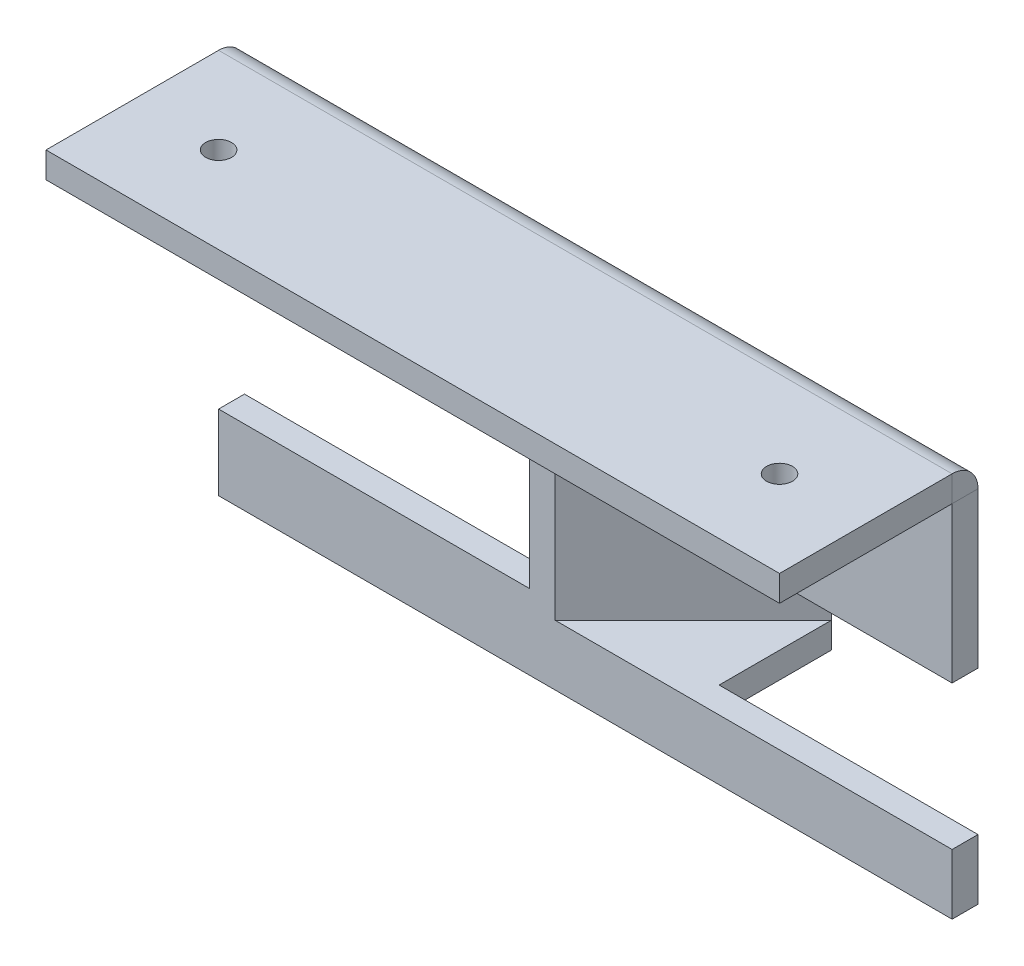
ISO-10303-21;
HEADER;
FILE_DESCRIPTION(('STEP AP214'),'2;1');
FILE_NAME('part.step','',(''),(''),'','','');
FILE_SCHEMA(('AUTOMOTIVE_DESIGN { 1 0 10303 214 1 1 1 1 }'));
ENDSEC;
DATA;
#1=APPLICATION_CONTEXT('core data for automotive mechanical design processes');
#2=APPLICATION_PROTOCOL_DEFINITION('international standard','automotive_design',2000,#1);
#3=PRODUCT_CONTEXT('',#1,'mechanical');
#4=PRODUCT('Part','Part','',(#3));
#5=PRODUCT_RELATED_PRODUCT_CATEGORY('part','',(#4));
#6=PRODUCT_DEFINITION_FORMATION('','',#4);
#7=PRODUCT_DEFINITION_CONTEXT('part definition',#1,'design');
#8=PRODUCT_DEFINITION('design','',#6,#7);
#9=PRODUCT_DEFINITION_SHAPE('','',#8);
#10=(LENGTH_UNIT() NAMED_UNIT(*) SI_UNIT(.MILLI.,.METRE.));
#11=(NAMED_UNIT(*) PLANE_ANGLE_UNIT() SI_UNIT($,.RADIAN.));
#12=(NAMED_UNIT(*) SI_UNIT($,.STERADIAN.) SOLID_ANGLE_UNIT());
#13=UNCERTAINTY_MEASURE_WITH_UNIT(LENGTH_MEASURE(1.E-05),#10,'distance_accuracy_value','');
#14=(GEOMETRIC_REPRESENTATION_CONTEXT(3) GLOBAL_UNCERTAINTY_ASSIGNED_CONTEXT((#13)) GLOBAL_UNIT_ASSIGNED_CONTEXT((#10,
#11,#12)) REPRESENTATION_CONTEXT('',''));
#15=CARTESIAN_POINT('',(0.,0.,0.));
#16=DIRECTION('',(0.,0.,1.));
#17=DIRECTION('',(1.,0.,0.));
#18=AXIS2_PLACEMENT_3D('',#15,#16,#17);
#19=CARTESIAN_POINT('',(42.5,1.5,20.));
#20=DIRECTION('',(-1.,0.,0.));
#21=DIRECTION('',(0.,0.,-1.));
#22=AXIS2_PLACEMENT_3D('',#19,#20,#21);
#23=PLANE('',#22);
#24=DIRECTION('',(0.,0.,-1.));
#25=VECTOR('',#24,1.);
#26=CARTESIAN_POINT('',(42.5,1.5,20.));
#27=LINE('',#26,#25);
#28=CARTESIAN_POINT('',(42.5,1.5,0.));
#29=VERTEX_POINT('',#28);
#30=CARTESIAN_POINT('',(42.5,1.5,-20.));
#31=VERTEX_POINT('',#30);
#32=EDGE_CURVE('E50',#29,#31,#27,.T.);
#33=ORIENTED_EDGE('',*,*,#32,.F.);
#34=DIRECTION('',(0.,1.,0.));
#35=VECTOR('',#34,1.);
#36=CARTESIAN_POINT('',(42.5,-75.5,0.));
#37=LINE('',#36,#35);
#38=CARTESIAN_POINT('',(42.5,-1.5,0.));
#39=VERTEX_POINT('',#38);
#40=EDGE_CURVE('E181',#39,#29,#37,.T.);
#41=ORIENTED_EDGE('',*,*,#40,.F.);
#42=DIRECTION('',(0.,0.,-1.));
#43=VECTOR('',#42,1.);
#44=CARTESIAN_POINT('',(42.5,-1.5,20.));
#45=LINE('',#44,#43);
#46=CARTESIAN_POINT('',(42.5,-1.5,-20.));
#47=VERTEX_POINT('',#46);
#48=EDGE_CURVE('E199',#39,#47,#45,.T.);
#49=ORIENTED_EDGE('',*,*,#48,.T.);
#50=DIRECTION('',(0.,1.,0.));
#51=VECTOR('',#50,1.);
#52=CARTESIAN_POINT('',(42.5,1.5,-20.));
#53=LINE('',#52,#51);
#54=EDGE_CURVE('E338',#47,#31,#53,.T.);
#55=ORIENTED_EDGE('',*,*,#54,.T.);
#56=EDGE_LOOP('',(#33,#41,#49,#55));
#57=FACE_BOUND('',#56,.T.);
#58=ADVANCED_FACE('F41',(#57),#23,.F.);
#59=CARTESIAN_POINT('',(-42.5,1.5,20.));
#60=DIRECTION('',(-1.,0.,0.));
#61=DIRECTION('',(0.,0.,-1.));
#62=AXIS2_PLACEMENT_3D('',#59,#60,#61);
#63=PLANE('',#62);
#64=DIRECTION('',(0.,0.,-1.));
#65=VECTOR('',#64,1.);
#66=CARTESIAN_POINT('',(-42.5,-1.5,20.));
#67=LINE('',#66,#65);
#68=CARTESIAN_POINT('',(-42.5,-1.5,0.));
#69=VERTEX_POINT('',#68);
#70=CARTESIAN_POINT('',(-42.5,-1.5,-20.));
#71=VERTEX_POINT('',#70);
#72=EDGE_CURVE('E192',#69,#71,#67,.T.);
#73=ORIENTED_EDGE('',*,*,#72,.F.);
#74=DIRECTION('',(0.,1.,0.));
#75=VECTOR('',#74,1.);
#76=CARTESIAN_POINT('',(-42.5,-75.5,0.));
#77=LINE('',#76,#75);
#78=CARTESIAN_POINT('',(-42.5,1.5,0.));
#79=VERTEX_POINT('',#78);
#80=EDGE_CURVE('E58',#69,#79,#77,.T.);
#81=ORIENTED_EDGE('',*,*,#80,.T.);
#82=DIRECTION('',(0.,0.,-1.));
#83=VECTOR('',#82,1.);
#84=CARTESIAN_POINT('',(-42.5,1.5,20.));
#85=LINE('',#84,#83);
#86=CARTESIAN_POINT('',(-42.5,1.5,-20.));
#87=VERTEX_POINT('',#86);
#88=EDGE_CURVE('E190',#79,#87,#85,.T.);
#89=ORIENTED_EDGE('',*,*,#88,.T.);
#90=DIRECTION('',(0.,1.,0.));
#91=VECTOR('',#90,1.);
#92=CARTESIAN_POINT('',(-42.5,1.5,-20.));
#93=LINE('',#92,#91);
#94=EDGE_CURVE('E343',#71,#87,#93,.T.);
#95=ORIENTED_EDGE('',*,*,#94,.F.);
#96=EDGE_LOOP('',(#73,#81,#89,#95));
#97=FACE_BOUND('',#96,.T.);
#98=ADVANCED_FACE('F43',(#97),#63,.T.);
#99=CARTESIAN_POINT('',(-42.5,1.5,20.));
#100=DIRECTION('',(0.,-1.,0.));
#101=DIRECTION('',(0.,0.,-1.));
#102=AXIS2_PLACEMENT_3D('',#99,#100,#101);
#103=PLANE('',#102);
#104=CARTESIAN_POINT('',(32.5,1.5,-9.99999999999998));
#105=DIRECTION('',(0.,1.,0.));
#106=DIRECTION('',(0.,0.,-1.));
#107=AXIS2_PLACEMENT_3D('',#104,#105,#106);
#108=CIRCLE('',#107,1.5);
#109=CARTESIAN_POINT('',(32.5,1.5,-11.5));
#110=VERTEX_POINT('',#109);
#111=EDGE_CURVE('E216',#110,#110,#108,.T.);
#112=ORIENTED_EDGE('',*,*,#111,.F.);
#113=EDGE_LOOP('',(#112));
#114=FACE_BOUND('',#113,.T.);
#115=CARTESIAN_POINT('',(-32.5,1.5,-9.99999999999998));
#116=DIRECTION('',(0.,1.,0.));
#117=DIRECTION('',(0.,0.,1.));
#118=AXIS2_PLACEMENT_3D('',#115,#116,#117);
#119=CIRCLE('',#118,1.5);
#120=CARTESIAN_POINT('',(-32.5,1.5,-8.49999999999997));
#121=VERTEX_POINT('',#120);
#122=EDGE_CURVE('E208',#121,#121,#119,.T.);
#123=ORIENTED_EDGE('',*,*,#122,.F.);
#124=EDGE_LOOP('',(#123));
#125=FACE_BOUND('',#124,.T.);
#126=DIRECTION('',(1.,0.,0.));
#127=VECTOR('',#126,1.);
#128=CARTESIAN_POINT('',(0.,1.5,0.));
#129=LINE('',#128,#127);
#130=EDGE_CURVE('E178',#79,#29,#129,.T.);
#131=ORIENTED_EDGE('',*,*,#130,.T.);
#132=ORIENTED_EDGE('',*,*,#32,.T.);
#133=DIRECTION('',(-1.,0.,0.));
#134=VECTOR('',#133,1.);
#135=CARTESIAN_POINT('',(-42.5,1.5,-20.));
#136=LINE('',#135,#134);
#137=EDGE_CURVE('E197',#31,#87,#136,.T.);
#138=ORIENTED_EDGE('',*,*,#137,.T.);
#139=ORIENTED_EDGE('',*,*,#88,.F.);
#140=EDGE_LOOP('',(#131,#132,#138,#139));
#141=FACE_BOUND('',#140,.T.);
#142=ADVANCED_FACE('F195',(#114,#125,#141),#103,.F.);
#143=CARTESIAN_POINT('',(-42.5,-1.5,20.));
#144=DIRECTION('',(0.,-1.,0.));
#145=DIRECTION('',(0.,0.,-1.));
#146=AXIS2_PLACEMENT_3D('',#143,#144,#145);
#147=PLANE('',#146);
#148=CARTESIAN_POINT('',(32.5,-1.5,-9.99999999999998));
#149=DIRECTION('',(0.,-1.,0.));
#150=DIRECTION('',(0.,0.,-1.));
#151=AXIS2_PLACEMENT_3D('',#148,#149,#150);
#152=CIRCLE('',#151,1.5);
#153=CARTESIAN_POINT('',(32.5,-1.5,-11.5));
#154=VERTEX_POINT('',#153);
#155=EDGE_CURVE('E45',#154,#154,#152,.T.);
#156=ORIENTED_EDGE('',*,*,#155,.F.);
#157=EDGE_LOOP('',(#156));
#158=FACE_BOUND('',#157,.T.);
#159=CARTESIAN_POINT('',(-32.5,-1.5,-9.99999999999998));
#160=DIRECTION('',(0.,-1.,0.));
#161=DIRECTION('',(0.,0.,-1.));
#162=AXIS2_PLACEMENT_3D('',#159,#160,#161);
#163=CIRCLE('',#162,1.5);
#164=CARTESIAN_POINT('',(-32.5,-1.5,-11.5));
#165=VERTEX_POINT('',#164);
#166=EDGE_CURVE('E185',#165,#165,#163,.T.);
#167=ORIENTED_EDGE('',*,*,#166,.F.);
#168=EDGE_LOOP('',(#167));
#169=FACE_BOUND('',#168,.T.);
#170=ORIENTED_EDGE('',*,*,#48,.F.);
#171=DIRECTION('',(-1.,0.,0.));
#172=VECTOR('',#171,1.);
#173=CARTESIAN_POINT('',(-42.5,-1.5,0.));
#174=LINE('',#173,#172);
#175=EDGE_CURVE('E12',#39,#69,#174,.T.);
#176=ORIENTED_EDGE('',*,*,#175,.T.);
#177=ORIENTED_EDGE('',*,*,#72,.T.);
#178=DIRECTION('',(1.,0.,0.));
#179=VECTOR('',#178,1.);
#180=CARTESIAN_POINT('',(-42.5,-1.5,-20.));
#181=LINE('',#180,#179);
#182=EDGE_CURVE('E336',#47,#71,#181,.F.);
#183=ORIENTED_EDGE('',*,*,#182,.F.);
#184=EDGE_LOOP('',(#170,#176,#177,#183));
#185=FACE_BOUND('',#184,.T.);
#186=ADVANCED_FACE('F440',(#158,#169,#185),#147,.T.);
#187=CARTESIAN_POINT('',(0.,0.,-20.));
#188=DIRECTION('',(0.,0.,-1.));
#189=DIRECTION('',(0.,-1.,0.));
#190=AXIS2_PLACEMENT_3D('',#187,#188,#189);
#191=PLANE('',#190);
#192=DIRECTION('',(0.,1.,0.));
#193=VECTOR('',#192,1.);
#194=CARTESIAN_POINT('',(-3.50000000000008,0.,-20.));
#195=LINE('',#194,#193);
#196=CARTESIAN_POINT('',(-3.50000000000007,-36.2,-20.0000000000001));
#197=VERTEX_POINT('',#196);
#198=CARTESIAN_POINT('',(-3.50000000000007,-19.5,-20.0000000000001));
#199=VERTEX_POINT('',#198);
#200=EDGE_CURVE('E219',#197,#199,#195,.T.);
#201=ORIENTED_EDGE('',*,*,#200,.T.);
#202=DIRECTION('',(1.,0.,0.));
#203=VECTOR('',#202,1.);
#204=CARTESIAN_POINT('',(0.,-19.5,-20.0000000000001));
#205=LINE('',#204,#203);
#206=CARTESIAN_POINT('',(42.5,-19.5,-20.));
#207=VERTEX_POINT('',#206);
#208=EDGE_CURVE('E227',#199,#207,#205,.T.);
#209=ORIENTED_EDGE('',*,*,#208,.T.);
#210=DIRECTION('',(0.,-1.,0.));
#211=VECTOR('',#210,1.);
#212=CARTESIAN_POINT('',(42.5,-43.2,-20.0000000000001));
#213=LINE('',#212,#211);
#214=EDGE_CURVE('E314',#47,#207,#213,.T.);
#215=ORIENTED_EDGE('',*,*,#214,.F.);
#216=ORIENTED_EDGE('',*,*,#182,.T.);
#217=DIRECTION('',(0.,1.,0.));
#218=VECTOR('',#217,1.);
#219=CARTESIAN_POINT('',(-42.5,-1.5,-20.));
#220=LINE('',#219,#218);
#221=CARTESIAN_POINT('',(-42.5,-21.5,-20.0000000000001));
#222=VERTEX_POINT('',#221);
#223=EDGE_CURVE('E320',#222,#71,#220,.T.);
#224=ORIENTED_EDGE('',*,*,#223,.F.);
#225=DIRECTION('',(-1.,0.,0.));
#226=VECTOR('',#225,1.);
#227=CARTESIAN_POINT('',(0.,-21.5,-20.0000000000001));
#228=LINE('',#227,#226);
#229=CARTESIAN_POINT('',(-6.50000000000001,-21.5,-20.0000000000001));
#230=VERTEX_POINT('',#229);
#231=EDGE_CURVE('E349',#230,#222,#228,.T.);
#232=ORIENTED_EDGE('',*,*,#231,.F.);
#233=DIRECTION('',(0.,1.,0.));
#234=VECTOR('',#233,1.);
#235=CARTESIAN_POINT('',(-6.50000000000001,0.,-20.));
#236=LINE('',#235,#234);
#237=CARTESIAN_POINT('',(-6.50000000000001,-34.5,-20.0000000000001));
#238=VERTEX_POINT('',#237);
#239=EDGE_CURVE('E347',#238,#230,#236,.T.);
#240=ORIENTED_EDGE('',*,*,#239,.F.);
#241=DIRECTION('',(1.,0.,0.));
#242=VECTOR('',#241,1.);
#243=CARTESIAN_POINT('',(0.,-34.5,-20.0000000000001));
#244=LINE('',#243,#242);
#245=CARTESIAN_POINT('',(-42.5,-34.5,-20.0000000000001));
#246=VERTEX_POINT('',#245);
#247=EDGE_CURVE('E345',#246,#238,#244,.T.);
#248=ORIENTED_EDGE('',*,*,#247,.F.);
#249=CARTESIAN_POINT('',(-42.5,-43.2,-20.0000000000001));
#250=VERTEX_POINT('',#249);
#251=EDGE_CURVE('E302',#250,#246,#220,.T.);
#252=ORIENTED_EDGE('',*,*,#251,.F.);
#253=DIRECTION('',(-1.,0.,0.));
#254=VECTOR('',#253,1.);
#255=CARTESIAN_POINT('',(-42.5,-43.2,-20.0000000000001));
#256=LINE('',#255,#254);
#257=CARTESIAN_POINT('',(42.5,-43.2,-20.0000000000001));
#258=VERTEX_POINT('',#257);
#259=EDGE_CURVE('E317',#258,#250,#256,.T.);
#260=ORIENTED_EDGE('',*,*,#259,.F.);
#261=CARTESIAN_POINT('',(42.5,-36.2,-20.0000000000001));
#262=VERTEX_POINT('',#261);
#263=EDGE_CURVE('E293',#262,#258,#213,.T.);
#264=ORIENTED_EDGE('',*,*,#263,.F.);
#265=DIRECTION('',(-1.,0.,0.));
#266=VECTOR('',#265,1.);
#267=CARTESIAN_POINT('',(0.,-36.2,-20.0000000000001));
#268=LINE('',#267,#266);
#269=EDGE_CURVE('E230',#262,#197,#268,.T.);
#270=ORIENTED_EDGE('',*,*,#269,.T.);
#271=EDGE_LOOP('',(#201,#209,#215,#216,#224,#232,#240,#248,#252,#260,#264,#270));
#272=FACE_BOUND('',#271,.T.);
#273=ADVANCED_FACE('F437',(#272),#191,.F.);
#274=CARTESIAN_POINT('',(42.5,-43.2,-23.0000000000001));
#275=DIRECTION('',(1.,0.,0.));
#276=DIRECTION('',(0.,1.,0.));
#277=AXIS2_PLACEMENT_3D('',#274,#275,#276);
#278=PLANE('',#277);
#279=DIRECTION('',(0.,-1.,0.));
#280=VECTOR('',#279,1.);
#281=CARTESIAN_POINT('',(42.5,-43.2,-23.0000000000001));
#282=LINE('',#281,#280);
#283=CARTESIAN_POINT('',(42.5,-1.49999999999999,-23.));
#284=VERTEX_POINT('',#283);
#285=CARTESIAN_POINT('',(42.5,-19.5,-23.0000000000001));
#286=VERTEX_POINT('',#285);
#287=EDGE_CURVE('E303',#284,#286,#282,.T.);
#288=ORIENTED_EDGE('',*,*,#287,.F.);
#289=DIRECTION('',(0.,0.,1.));
#290=VECTOR('',#289,1.);
#291=CARTESIAN_POINT('',(42.5,-1.49999999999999,-23.));
#292=LINE('',#291,#290);
#293=EDGE_CURVE('E313',#284,#47,#292,.T.);
#294=ORIENTED_EDGE('',*,*,#293,.T.);
#295=ORIENTED_EDGE('',*,*,#214,.T.);
#296=DIRECTION('',(0.,0.,1.));
#297=VECTOR('',#296,1.);
#298=CARTESIAN_POINT('',(42.5,-19.5,-23.0000000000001));
#299=LINE('',#298,#297);
#300=EDGE_CURVE('E225',#286,#207,#299,.T.);
#301=ORIENTED_EDGE('',*,*,#300,.F.);
#302=EDGE_LOOP('',(#288,#294,#295,#301));
#303=FACE_BOUND('',#302,.T.);
#304=ADVANCED_FACE('F427',(#303),#278,.T.);
#305=CARTESIAN_POINT('',(0.,0.,-23.));
#306=DIRECTION('',(0.,0.,-1.));
#307=DIRECTION('',(0.,-1.,0.));
#308=AXIS2_PLACEMENT_3D('',#305,#306,#307);
#309=PLANE('',#308);
#310=DIRECTION('',(0.,1.,0.));
#311=VECTOR('',#310,1.);
#312=CARTESIAN_POINT('',(12.5,-19.5,-23.0000000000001));
#313=LINE('',#312,#311);
#314=CARTESIAN_POINT('',(12.5,-19.5,-23.0000000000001));
#315=VERTEX_POINT('',#314);
#316=CARTESIAN_POINT('',(12.5,-16.5,-23.0000000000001));
#317=VERTEX_POINT('',#316);
#318=EDGE_CURVE('E244',#315,#317,#313,.T.);
#319=ORIENTED_EDGE('',*,*,#318,.T.);
#320=DIRECTION('',(1.,0.,0.));
#321=VECTOR('',#320,1.);
#322=CARTESIAN_POINT('',(0.,-16.5,-23.0000000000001));
#323=LINE('',#322,#321);
#324=CARTESIAN_POINT('',(-4.74264068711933,-16.5,-23.0000000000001));
#325=VERTEX_POINT('',#324);
#326=EDGE_CURVE('E351',#325,#317,#323,.T.);
#327=ORIENTED_EDGE('',*,*,#326,.F.);
#328=DIRECTION('',(0.,1.,0.));
#329=VECTOR('',#328,1.);
#330=CARTESIAN_POINT('',(-4.74264068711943,0.,-23.));
#331=LINE('',#330,#329);
#332=CARTESIAN_POINT('',(-4.74264068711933,-39.2,-23.0000000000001));
#333=VERTEX_POINT('',#332);
#334=EDGE_CURVE('E204',#333,#325,#331,.T.);
#335=ORIENTED_EDGE('',*,*,#334,.F.);
#336=DIRECTION('',(1.,0.,0.));
#337=VECTOR('',#336,1.);
#338=CARTESIAN_POINT('',(-0.5,-39.2,-23.0000000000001));
#339=LINE('',#338,#337);
#340=CARTESIAN_POINT('',(12.5,-39.2,-23.0000000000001));
#341=VERTEX_POINT('',#340);
#342=EDGE_CURVE('E265',#333,#341,#339,.T.);
#343=ORIENTED_EDGE('',*,*,#342,.T.);
#344=DIRECTION('',(0.,-1.,0.));
#345=VECTOR('',#344,1.);
#346=CARTESIAN_POINT('',(12.5,-36.2,-23.0000000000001));
#347=LINE('',#346,#345);
#348=CARTESIAN_POINT('',(12.5,-36.2,-23.0000000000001));
#349=VERTEX_POINT('',#348);
#350=EDGE_CURVE('E271',#349,#341,#347,.T.);
#351=ORIENTED_EDGE('',*,*,#350,.F.);
#352=DIRECTION('',(-1.,0.,0.));
#353=VECTOR('',#352,1.);
#354=CARTESIAN_POINT('',(0.,-36.2,-23.0000000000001));
#355=LINE('',#354,#353);
#356=CARTESIAN_POINT('',(42.5,-36.2,-23.0000000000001));
#357=VERTEX_POINT('',#356);
#358=EDGE_CURVE('E231',#357,#349,#355,.T.);
#359=ORIENTED_EDGE('',*,*,#358,.F.);
#360=CARTESIAN_POINT('',(42.5,-43.2,-23.0000000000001));
#361=VERTEX_POINT('',#360);
#362=EDGE_CURVE('E301',#357,#361,#282,.T.);
#363=ORIENTED_EDGE('',*,*,#362,.T.);
#364=DIRECTION('',(-1.,0.,0.));
#365=VECTOR('',#364,1.);
#366=CARTESIAN_POINT('',(-42.5,-43.2,-23.0000000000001));
#367=LINE('',#366,#365);
#368=CARTESIAN_POINT('',(-42.5,-43.2,-23.0000000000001));
#369=VERTEX_POINT('',#368);
#370=EDGE_CURVE('E306',#361,#369,#367,.T.);
#371=ORIENTED_EDGE('',*,*,#370,.T.);
#372=DIRECTION('',(0.,1.,0.));
#373=VECTOR('',#372,1.);
#374=CARTESIAN_POINT('',(-42.5,-1.49999999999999,-23.));
#375=LINE('',#374,#373);
#376=CARTESIAN_POINT('',(-42.5,-34.5,-23.));
#377=VERTEX_POINT('',#376);
#378=EDGE_CURVE('E310',#369,#377,#375,.T.);
#379=ORIENTED_EDGE('',*,*,#378,.T.);
#380=DIRECTION('',(1.,0.,0.));
#381=VECTOR('',#380,1.);
#382=CARTESIAN_POINT('',(-42.5,-34.5,-23.));
#383=LINE('',#382,#381);
#384=CARTESIAN_POINT('',(-6.50000000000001,-34.5,-23.));
#385=VERTEX_POINT('',#384);
#386=EDGE_CURVE('E279',#377,#385,#383,.T.);
#387=ORIENTED_EDGE('',*,*,#386,.T.);
#388=DIRECTION('',(0.,1.,0.));
#389=VECTOR('',#388,1.);
#390=CARTESIAN_POINT('',(-6.50000000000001,-21.5,-23.));
#391=LINE('',#390,#389);
#392=CARTESIAN_POINT('',(-6.50000000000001,-21.5,-23.));
#393=VERTEX_POINT('',#392);
#394=EDGE_CURVE('E284',#385,#393,#391,.T.);
#395=ORIENTED_EDGE('',*,*,#394,.T.);
#396=DIRECTION('',(-1.,0.,0.));
#397=VECTOR('',#396,1.);
#398=CARTESIAN_POINT('',(-42.5,-21.5,-23.));
#399=LINE('',#398,#397);
#400=CARTESIAN_POINT('',(-42.5,-21.5,-23.));
#401=VERTEX_POINT('',#400);
#402=EDGE_CURVE('E287',#393,#401,#399,.T.);
#403=ORIENTED_EDGE('',*,*,#402,.T.);
#404=CARTESIAN_POINT('',(-42.5,-1.49999999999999,-23.));
#405=VERTEX_POINT('',#404);
#406=EDGE_CURVE('E309',#401,#405,#375,.T.);
#407=ORIENTED_EDGE('',*,*,#406,.T.);
#408=DIRECTION('',(1.,0.,0.));
#409=VECTOR('',#408,1.);
#410=CARTESIAN_POINT('',(42.5,-1.49999999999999,-23.));
#411=LINE('',#410,#409);
#412=EDGE_CURVE('E298',#405,#284,#411,.T.);
#413=ORIENTED_EDGE('',*,*,#412,.T.);
#414=ORIENTED_EDGE('',*,*,#287,.T.);
#415=DIRECTION('',(1.,0.,0.));
#416=VECTOR('',#415,1.);
#417=CARTESIAN_POINT('',(0.,-19.5,-23.0000000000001));
#418=LINE('',#417,#416);
#419=EDGE_CURVE('E223',#315,#286,#418,.T.);
#420=ORIENTED_EDGE('',*,*,#419,.F.);
#421=EDGE_LOOP('',(#319,#327,#335,#343,#351,#359,#363,#371,#379,#387,#395,#403,#407,#413,#414,#420));
#422=FACE_BOUND('',#421,.T.);
#423=ADVANCED_FACE('F364',(#422),#309,.T.);
#424=ORIENTED_EDGE('',*,*,#263,.T.);
#425=DIRECTION('',(0.,0.,1.));
#426=VECTOR('',#425,1.);
#427=CARTESIAN_POINT('',(42.5,-43.2,-23.0000000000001));
#428=LINE('',#427,#426);
#429=EDGE_CURVE('E329',#361,#258,#428,.T.);
#430=ORIENTED_EDGE('',*,*,#429,.F.);
#431=ORIENTED_EDGE('',*,*,#362,.F.);
#432=DIRECTION('',(0.,0.,-1.));
#433=VECTOR('',#432,1.);
#434=CARTESIAN_POINT('',(42.5,-36.2,-23.0000000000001));
#435=LINE('',#434,#433);
#436=EDGE_CURVE('E235',#262,#357,#435,.T.);
#437=ORIENTED_EDGE('',*,*,#436,.F.);
#438=EDGE_LOOP('',(#424,#430,#431,#437));
#439=FACE_BOUND('',#438,.T.);
#440=ADVANCED_FACE('F390',(#439),#278,.T.);
#441=CARTESIAN_POINT('',(-11.7500000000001,0.,-11.7500000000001));
#442=DIRECTION('',(0.707106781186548,0.,0.707106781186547));
#443=DIRECTION('',(-0.707106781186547,0.,0.707106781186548));
#444=AXIS2_PLACEMENT_3D('',#441,#442,#443);
#445=PLANE('',#444);
#446=DIRECTION('',(-0.707106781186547,0.,0.707106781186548));
#447=VECTOR('',#446,1.);
#448=CARTESIAN_POINT('',(-0.5,-36.2,-23.0000000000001));
#449=LINE('',#448,#447);
#450=CARTESIAN_POINT('',(12.5,-36.2,-36.0000000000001));
#451=VERTEX_POINT('',#450);
#452=EDGE_CURVE('E268',#451,#197,#449,.T.);
#453=ORIENTED_EDGE('',*,*,#452,.F.);
#454=DIRECTION('',(0.,1.,0.));
#455=VECTOR('',#454,1.);
#456=CARTESIAN_POINT('',(12.5,-16.5,-36.0000000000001));
#457=LINE('',#456,#455);
#458=CARTESIAN_POINT('',(12.5,-19.5,-36.0000000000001));
#459=VERTEX_POINT('',#458);
#460=EDGE_CURVE('E248',#451,#459,#457,.T.);
#461=ORIENTED_EDGE('',*,*,#460,.T.);
#462=DIRECTION('',(0.707106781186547,0.,-0.707106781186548));
#463=VECTOR('',#462,1.);
#464=CARTESIAN_POINT('',(-0.500000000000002,-19.5,-23.0000000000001));
#465=LINE('',#464,#463);
#466=EDGE_CURVE('E241',#199,#459,#465,.T.);
#467=ORIENTED_EDGE('',*,*,#466,.F.);
#468=ORIENTED_EDGE('',*,*,#200,.F.);
#469=EDGE_LOOP('',(#453,#461,#467,#468));
#470=FACE_BOUND('',#469,.T.);
#471=ADVANCED_FACE('F435',(#470),#445,.T.);
#472=CARTESIAN_POINT('',(-42.5,-1.49999999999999,-23.));
#473=DIRECTION('',(-1.,0.,0.));
#474=DIRECTION('',(0.,0.,-1.));
#475=AXIS2_PLACEMENT_3D('',#472,#473,#474);
#476=PLANE('',#475);
#477=DIRECTION('',(0.,0.,-1.));
#478=VECTOR('',#477,1.);
#479=CARTESIAN_POINT('',(-42.5,-21.5,7.00000000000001));
#480=LINE('',#479,#478);
#481=EDGE_CURVE('E291',#222,#401,#480,.T.);
#482=ORIENTED_EDGE('',*,*,#481,.F.);
#483=ORIENTED_EDGE('',*,*,#223,.T.);
#484=DIRECTION('',(0.,0.,1.));
#485=VECTOR('',#484,1.);
#486=CARTESIAN_POINT('',(-42.5,-1.49999999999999,-23.));
#487=LINE('',#486,#485);
#488=EDGE_CURVE('E323',#405,#71,#487,.T.);
#489=ORIENTED_EDGE('',*,*,#488,.F.);
#490=ORIENTED_EDGE('',*,*,#406,.F.);
#491=EDGE_LOOP('',(#482,#483,#489,#490));
#492=FACE_BOUND('',#491,.T.);
#493=ADVANCED_FACE('F415',(#492),#476,.T.);
#494=CARTESIAN_POINT('',(-42.5,1.5,-20.));
#495=DIRECTION('',(-1.,0.,0.));
#496=DIRECTION('',(0.,0.,-1.));
#497=AXIS2_PLACEMENT_3D('',#494,#495,#496);
#498=PLANE('',#497);
#499=CARTESIAN_POINT('',(-42.5,-1.5,-20.));
#500=DIRECTION('',(-1.,0.,0.));
#501=DIRECTION('',(0.,0.,1.));
#502=AXIS2_PLACEMENT_3D('',#499,#500,#501);
#503=CIRCLE('',#502,3.);
#504=EDGE_CURVE('E334',#87,#405,#503,.T.);
#505=ORIENTED_EDGE('',*,*,#504,.T.);
#506=ORIENTED_EDGE('',*,*,#488,.T.);
#507=ORIENTED_EDGE('',*,*,#94,.T.);
#508=EDGE_LOOP('',(#505,#506,#507));
#509=FACE_BOUND('',#508,.T.);
#510=ADVANCED_FACE('F442',(#509),#498,.T.);
#511=CARTESIAN_POINT('',(42.5,-1.5,-20.));
#512=DIRECTION('',(1.,0.,0.));
#513=DIRECTION('',(0.,0.,1.));
#514=AXIS2_PLACEMENT_3D('',#511,#512,#513);
#515=CYLINDRICAL_SURFACE('',#514,3.);
#516=CARTESIAN_POINT('',(42.5,-1.5,-20.));
#517=DIRECTION('',(-1.,0.,0.));
#518=DIRECTION('',(0.,0.,1.));
#519=AXIS2_PLACEMENT_3D('',#516,#517,#518);
#520=CIRCLE('',#519,3.);
#521=EDGE_CURVE('E326',#31,#284,#520,.T.);
#522=ORIENTED_EDGE('',*,*,#521,.T.);
#523=ORIENTED_EDGE('',*,*,#412,.F.);
#524=ORIENTED_EDGE('',*,*,#504,.F.);
#525=ORIENTED_EDGE('',*,*,#137,.F.);
#526=EDGE_LOOP('',(#522,#523,#524,#525));
#527=FACE_BOUND('',#526,.T.);
#528=ADVANCED_FACE('F443',(#527),#515,.T.);
#529=CARTESIAN_POINT('',(42.5,1.5,-20.));
#530=DIRECTION('',(-1.,0.,0.));
#531=DIRECTION('',(0.,0.,-1.));
#532=AXIS2_PLACEMENT_3D('',#529,#530,#531);
#533=PLANE('',#532);
#534=ORIENTED_EDGE('',*,*,#54,.F.);
#535=ORIENTED_EDGE('',*,*,#293,.F.);
#536=ORIENTED_EDGE('',*,*,#521,.F.);
#537=EDGE_LOOP('',(#534,#535,#536));
#538=FACE_BOUND('',#537,.T.);
#539=ADVANCED_FACE('F423',(#538),#533,.F.);
#540=DIRECTION('',(0.,0.,-1.));
#541=VECTOR('',#540,1.);
#542=CARTESIAN_POINT('',(-42.5,-34.5,7.00000000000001));
#543=LINE('',#542,#541);
#544=EDGE_CURVE('E290',#246,#377,#543,.T.);
#545=ORIENTED_EDGE('',*,*,#544,.T.);
#546=ORIENTED_EDGE('',*,*,#378,.F.);
#547=DIRECTION('',(0.,0.,1.));
#548=VECTOR('',#547,1.);
#549=CARTESIAN_POINT('',(-42.5,-43.2,-23.0000000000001));
#550=LINE('',#549,#548);
#551=EDGE_CURVE('E327',#369,#250,#550,.T.);
#552=ORIENTED_EDGE('',*,*,#551,.T.);
#553=ORIENTED_EDGE('',*,*,#251,.T.);
#554=EDGE_LOOP('',(#545,#546,#552,#553));
#555=FACE_BOUND('',#554,.T.);
#556=ADVANCED_FACE('F398',(#555),#476,.T.);
#557=CARTESIAN_POINT('',(-42.5,-43.2,-23.0000000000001));
#558=DIRECTION('',(0.,-1.,0.));
#559=DIRECTION('',(0.,0.,1.));
#560=AXIS2_PLACEMENT_3D('',#557,#558,#559);
#561=PLANE('',#560);
#562=ORIENTED_EDGE('',*,*,#259,.T.);
#563=ORIENTED_EDGE('',*,*,#551,.F.);
#564=ORIENTED_EDGE('',*,*,#370,.F.);
#565=ORIENTED_EDGE('',*,*,#429,.T.);
#566=EDGE_LOOP('',(#562,#563,#564,#565));
#567=FACE_BOUND('',#566,.T.);
#568=ADVANCED_FACE('F394',(#567),#561,.T.);
#569=CARTESIAN_POINT('',(-42.5,-21.5,7.00000000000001));
#570=DIRECTION('',(0.,1.,0.));
#571=DIRECTION('',(-1.,0.,0.));
#572=AXIS2_PLACEMENT_3D('',#569,#570,#571);
#573=PLANE('',#572);
#574=DIRECTION('',(0.,0.,-1.));
#575=VECTOR('',#574,1.);
#576=CARTESIAN_POINT('',(-6.50000000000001,-21.5,7.00000000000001));
#577=LINE('',#576,#575);
#578=EDGE_CURVE('E294',#230,#393,#577,.T.);
#579=ORIENTED_EDGE('',*,*,#578,.F.);
#580=ORIENTED_EDGE('',*,*,#231,.T.);
#581=ORIENTED_EDGE('',*,*,#481,.T.);
#582=ORIENTED_EDGE('',*,*,#402,.F.);
#583=EDGE_LOOP('',(#579,#580,#581,#582));
#584=FACE_BOUND('',#583,.T.);
#585=ADVANCED_FACE('F409',(#584),#573,.F.);
#586=CARTESIAN_POINT('',(-6.50000000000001,-21.5,7.00000000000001));
#587=DIRECTION('',(1.,0.,0.));
#588=DIRECTION('',(0.,1.,0.));
#589=AXIS2_PLACEMENT_3D('',#586,#587,#588);
#590=PLANE('',#589);
#591=DIRECTION('',(0.,0.,-1.));
#592=VECTOR('',#591,1.);
#593=CARTESIAN_POINT('',(-6.50000000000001,-34.5,7.00000000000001));
#594=LINE('',#593,#592);
#595=EDGE_CURVE('E65',#238,#385,#594,.T.);
#596=ORIENTED_EDGE('',*,*,#595,.F.);
#597=ORIENTED_EDGE('',*,*,#239,.T.);
#598=ORIENTED_EDGE('',*,*,#578,.T.);
#599=ORIENTED_EDGE('',*,*,#394,.F.);
#600=EDGE_LOOP('',(#596,#597,#598,#599));
#601=FACE_BOUND('',#600,.T.);
#602=ADVANCED_FACE('F405',(#601),#590,.F.);
#603=CARTESIAN_POINT('',(-42.5,-34.5,7.00000000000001));
#604=DIRECTION('',(0.,-1.,0.));
#605=DIRECTION('',(0.,0.,1.));
#606=AXIS2_PLACEMENT_3D('',#603,#604,#605);
#607=PLANE('',#606);
#608=ORIENTED_EDGE('',*,*,#544,.F.);
#609=ORIENTED_EDGE('',*,*,#247,.T.);
#610=ORIENTED_EDGE('',*,*,#595,.T.);
#611=ORIENTED_EDGE('',*,*,#386,.F.);
#612=EDGE_LOOP('',(#608,#609,#610,#611));
#613=FACE_BOUND('',#612,.T.);
#614=ADVANCED_FACE('F402',(#613),#607,.F.);
#615=CARTESIAN_POINT('',(12.5,-36.2,-23.0000000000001));
#616=DIRECTION('',(1.,0.,0.));
#617=DIRECTION('',(0.,0.,1.));
#618=AXIS2_PLACEMENT_3D('',#615,#616,#617);
#619=PLANE('',#618);
#620=DIRECTION('',(0.,0.,-1.));
#621=VECTOR('',#620,1.);
#622=CARTESIAN_POINT('',(12.5,-39.2,-23.0000000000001));
#623=LINE('',#622,#621);
#624=CARTESIAN_POINT('',(12.5,-39.2,-36.0000000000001));
#625=VERTEX_POINT('',#624);
#626=EDGE_CURVE('E269',#341,#625,#623,.T.);
#627=ORIENTED_EDGE('',*,*,#626,.T.);
#628=DIRECTION('',(0.,-1.,0.));
#629=VECTOR('',#628,1.);
#630=CARTESIAN_POINT('',(12.5,-36.2,-36.0000000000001));
#631=LINE('',#630,#629);
#632=EDGE_CURVE('E276',#451,#625,#631,.T.);
#633=ORIENTED_EDGE('',*,*,#632,.F.);
#634=DIRECTION('',(0.,0.,-1.));
#635=VECTOR('',#634,1.);
#636=CARTESIAN_POINT('',(12.5,-36.2,-23.0000000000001));
#637=LINE('',#636,#635);
#638=EDGE_CURVE('E266',#349,#451,#637,.T.);
#639=ORIENTED_EDGE('',*,*,#638,.F.);
#640=ORIENTED_EDGE('',*,*,#350,.T.);
#641=EDGE_LOOP('',(#627,#633,#639,#640));
#642=FACE_BOUND('',#641,.T.);
#643=ADVANCED_FACE('F382',(#642),#619,.T.);
#644=CARTESIAN_POINT('',(0.,-36.2000000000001,-1.13910499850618E-13));
#645=DIRECTION('',(0.,-1.,0.));
#646=DIRECTION('',(0.,0.,1.));
#647=AXIS2_PLACEMENT_3D('',#644,#645,#646);
#648=PLANE('',#647);
#649=ORIENTED_EDGE('',*,*,#638,.T.);
#650=ORIENTED_EDGE('',*,*,#452,.T.);
#651=ORIENTED_EDGE('',*,*,#269,.F.);
#652=ORIENTED_EDGE('',*,*,#436,.T.);
#653=ORIENTED_EDGE('',*,*,#358,.T.);
#654=EDGE_LOOP('',(#649,#650,#651,#652,#653));
#655=FACE_BOUND('',#654,.T.);
#656=ADVANCED_FACE('F384',(#655),#648,.F.);
#657=CARTESIAN_POINT('',(0.,-39.2000000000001,-1.24384943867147E-13));
#658=DIRECTION('',(0.,-1.,0.));
#659=DIRECTION('',(0.,0.,1.));
#660=AXIS2_PLACEMENT_3D('',#657,#658,#659);
#661=PLANE('',#660);
#662=ORIENTED_EDGE('',*,*,#342,.F.);
#663=DIRECTION('',(0.707106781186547,0.,-0.707106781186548));
#664=VECTOR('',#663,1.);
#665=CARTESIAN_POINT('',(10.3786796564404,-39.2,-38.1213203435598));
#666=LINE('',#665,#664);
#667=CARTESIAN_POINT('',(10.3786796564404,-39.2,-38.1213203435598));
#668=VERTEX_POINT('',#667);
#669=EDGE_CURVE('E253',#333,#668,#666,.T.);
#670=ORIENTED_EDGE('',*,*,#669,.T.);
#671=DIRECTION('',(0.707106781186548,0.,0.707106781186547));
#672=VECTOR('',#671,1.);
#673=CARTESIAN_POINT('',(10.3786796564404,-39.2,-38.1213203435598));
#674=LINE('',#673,#672);
#675=EDGE_CURVE('E263',#668,#625,#674,.T.);
#676=ORIENTED_EDGE('',*,*,#675,.T.);
#677=ORIENTED_EDGE('',*,*,#626,.F.);
#678=EDGE_LOOP('',(#662,#670,#676,#677));
#679=FACE_BOUND('',#678,.T.);
#680=ADVANCED_FACE('F377',(#679),#661,.T.);
#681=CARTESIAN_POINT('',(-5.17766952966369,-16.5,-22.5649711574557));
#682=DIRECTION('',(0.,-1.,0.));
#683=DIRECTION('',(0.,0.,1.));
#684=AXIS2_PLACEMENT_3D('',#681,#682,#683);
#685=PLANE('',#684);
#686=ORIENTED_EDGE('',*,*,#326,.T.);
#687=DIRECTION('',(0.,0.,1.));
#688=VECTOR('',#687,1.);
#689=CARTESIAN_POINT('',(12.5,-16.5,-36.0000000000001));
#690=LINE('',#689,#688);
#691=CARTESIAN_POINT('',(12.5,-16.5,-36.0000000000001));
#692=VERTEX_POINT('',#691);
#693=EDGE_CURVE('E234',#692,#317,#690,.T.);
#694=ORIENTED_EDGE('',*,*,#693,.F.);
#695=DIRECTION('',(0.707106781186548,0.,0.707106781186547));
#696=VECTOR('',#695,1.);
#697=CARTESIAN_POINT('',(10.3786796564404,-16.5,-38.1213203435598));
#698=LINE('',#697,#696);
#699=CARTESIAN_POINT('',(10.3786796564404,-16.5,-38.1213203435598));
#700=VERTEX_POINT('',#699);
#701=EDGE_CURVE('E258',#700,#692,#698,.T.);
#702=ORIENTED_EDGE('',*,*,#701,.F.);
#703=DIRECTION('',(-0.707106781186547,0.,0.707106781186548));
#704=VECTOR('',#703,1.);
#705=CARTESIAN_POINT('',(-5.17766952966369,-16.5,-22.5649711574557));
#706=LINE('',#705,#704);
#707=EDGE_CURVE('E251',#700,#325,#706,.T.);
#708=ORIENTED_EDGE('',*,*,#707,.T.);
#709=EDGE_LOOP('',(#686,#694,#702,#708));
#710=FACE_BOUND('',#709,.T.);
#711=ADVANCED_FACE('F370',(#710),#685,.F.);
#712=CARTESIAN_POINT('',(10.3786796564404,-16.5,-38.1213203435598));
#713=DIRECTION('',(-0.707106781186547,0.,0.707106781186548));
#714=DIRECTION('',(-0.707106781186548,0.,-0.707106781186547));
#715=AXIS2_PLACEMENT_3D('',#712,#713,#714);
#716=PLANE('',#715);
#717=ORIENTED_EDGE('',*,*,#632,.T.);
#718=ORIENTED_EDGE('',*,*,#675,.F.);
#719=DIRECTION('',(0.,1.,0.));
#720=VECTOR('',#719,1.);
#721=CARTESIAN_POINT('',(10.3786796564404,-16.5,-38.1213203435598));
#722=LINE('',#721,#720);
#723=EDGE_CURVE('E256',#668,#700,#722,.T.);
#724=ORIENTED_EDGE('',*,*,#723,.T.);
#725=ORIENTED_EDGE('',*,*,#701,.T.);
#726=DIRECTION('',(0.,1.,0.));
#727=VECTOR('',#726,1.);
#728=CARTESIAN_POINT('',(12.5,-19.5,-36.0000000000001));
#729=LINE('',#728,#727);
#730=EDGE_CURVE('E246',#459,#692,#729,.T.);
#731=ORIENTED_EDGE('',*,*,#730,.F.);
#732=ORIENTED_EDGE('',*,*,#460,.F.);
#733=EDGE_LOOP('',(#717,#718,#724,#725,#731,#732));
#734=FACE_BOUND('',#733,.T.);
#735=ADVANCED_FACE('F372',(#734),#716,.F.);
#736=CARTESIAN_POINT('',(-13.8713203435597,0.,-13.8713203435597));
#737=DIRECTION('',(0.707106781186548,0.,0.707106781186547));
#738=DIRECTION('',(-0.707106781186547,0.,0.707106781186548));
#739=AXIS2_PLACEMENT_3D('',#736,#737,#738);
#740=PLANE('',#739);
#741=ORIENTED_EDGE('',*,*,#334,.T.);
#742=ORIENTED_EDGE('',*,*,#707,.F.);
#743=ORIENTED_EDGE('',*,*,#723,.F.);
#744=ORIENTED_EDGE('',*,*,#669,.F.);
#745=EDGE_LOOP('',(#741,#742,#743,#744));
#746=FACE_BOUND('',#745,.T.);
#747=ADVANCED_FACE('F360',(#746),#740,.F.);
#748=CARTESIAN_POINT('',(12.5,-19.5,-36.0000000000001));
#749=DIRECTION('',(1.,0.,0.));
#750=DIRECTION('',(0.,0.,1.));
#751=AXIS2_PLACEMENT_3D('',#748,#749,#750);
#752=PLANE('',#751);
#753=ORIENTED_EDGE('',*,*,#693,.T.);
#754=ORIENTED_EDGE('',*,*,#318,.F.);
#755=DIRECTION('',(0.,0.,1.));
#756=VECTOR('',#755,1.);
#757=CARTESIAN_POINT('',(12.5,-19.5,-36.0000000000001));
#758=LINE('',#757,#756);
#759=EDGE_CURVE('E239',#459,#315,#758,.T.);
#760=ORIENTED_EDGE('',*,*,#759,.F.);
#761=ORIENTED_EDGE('',*,*,#730,.T.);
#762=EDGE_LOOP('',(#753,#754,#760,#761));
#763=FACE_BOUND('',#762,.T.);
#764=ADVANCED_FACE('F368',(#763),#752,.T.);
#765=CARTESIAN_POINT('',(0.,-19.5,0.));
#766=DIRECTION('',(0.,1.,0.));
#767=DIRECTION('',(0.,0.,-1.));
#768=AXIS2_PLACEMENT_3D('',#765,#766,#767);
#769=PLANE('',#768);
#770=ORIENTED_EDGE('',*,*,#466,.T.);
#771=ORIENTED_EDGE('',*,*,#759,.T.);
#772=ORIENTED_EDGE('',*,*,#419,.T.);
#773=ORIENTED_EDGE('',*,*,#300,.T.);
#774=ORIENTED_EDGE('',*,*,#208,.F.);
#775=EDGE_LOOP('',(#770,#771,#772,#773,#774));
#776=FACE_BOUND('',#775,.T.);
#777=ADVANCED_FACE('F431',(#776),#769,.F.);
#778=CARTESIAN_POINT('',(0.,-75.5,0.));
#779=DIRECTION('',(0.,0.,1.));
#780=DIRECTION('',(1.,0.,0.));
#781=AXIS2_PLACEMENT_3D('',#778,#779,#780);
#782=PLANE('',#781);
#783=ORIENTED_EDGE('',*,*,#40,.T.);
#784=ORIENTED_EDGE('',*,*,#130,.F.);
#785=ORIENTED_EDGE('',*,*,#80,.F.);
#786=ORIENTED_EDGE('',*,*,#175,.F.);
#787=EDGE_LOOP('',(#783,#784,#785,#786));
#788=FACE_BOUND('',#787,.T.);
#789=ADVANCED_FACE('F179',(#788),#782,.T.);
#790=CARTESIAN_POINT('',(-32.5,-8.5,-9.99999999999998));
#791=DIRECTION('',(0.,1.,0.));
#792=DIRECTION('',(0.,0.,1.));
#793=AXIS2_PLACEMENT_3D('',#790,#791,#792);
#794=CYLINDRICAL_SURFACE('',#793,1.5);
#795=ORIENTED_EDGE('',*,*,#166,.T.);
#796=EDGE_LOOP('',(#795));
#797=FACE_BOUND('',#796,.T.);
#798=ORIENTED_EDGE('',*,*,#122,.T.);
#799=EDGE_LOOP('',(#798));
#800=FACE_BOUND('',#799,.T.);
#801=ADVANCED_FACE('F498',(#797,#800),#794,.F.);
#802=CARTESIAN_POINT('',(32.5,-8.5,-9.99999999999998));
#803=DIRECTION('',(0.,1.,0.));
#804=DIRECTION('',(0.,0.,1.));
#805=AXIS2_PLACEMENT_3D('',#802,#803,#804);
#806=CYLINDRICAL_SURFACE('',#805,1.5);
#807=ORIENTED_EDGE('',*,*,#155,.T.);
#808=EDGE_LOOP('',(#807));
#809=FACE_BOUND('',#808,.T.);
#810=ORIENTED_EDGE('',*,*,#111,.T.);
#811=EDGE_LOOP('',(#810));
#812=FACE_BOUND('',#811,.T.);
#813=ADVANCED_FACE('F501',(#809,#812),#806,.F.);
#814=CLOSED_SHELL('',(#58,#98,#142,#186,#273,#304,#423,#440,#471,#493,#510,#528,#539,#556,#568,
#585,#602,#614,#643,#656,#680,#711,#735,#747,#764,#777,#789,#801,#813));
#815=MANIFOLD_SOLID_BREP('B2',#814);
#816=ADVANCED_BREP_SHAPE_REPRESENTATION('',(#18,#815),#14);
#817=SHAPE_DEFINITION_REPRESENTATION(#9,#816);
ENDSEC;
END-ISO-10303-21;
